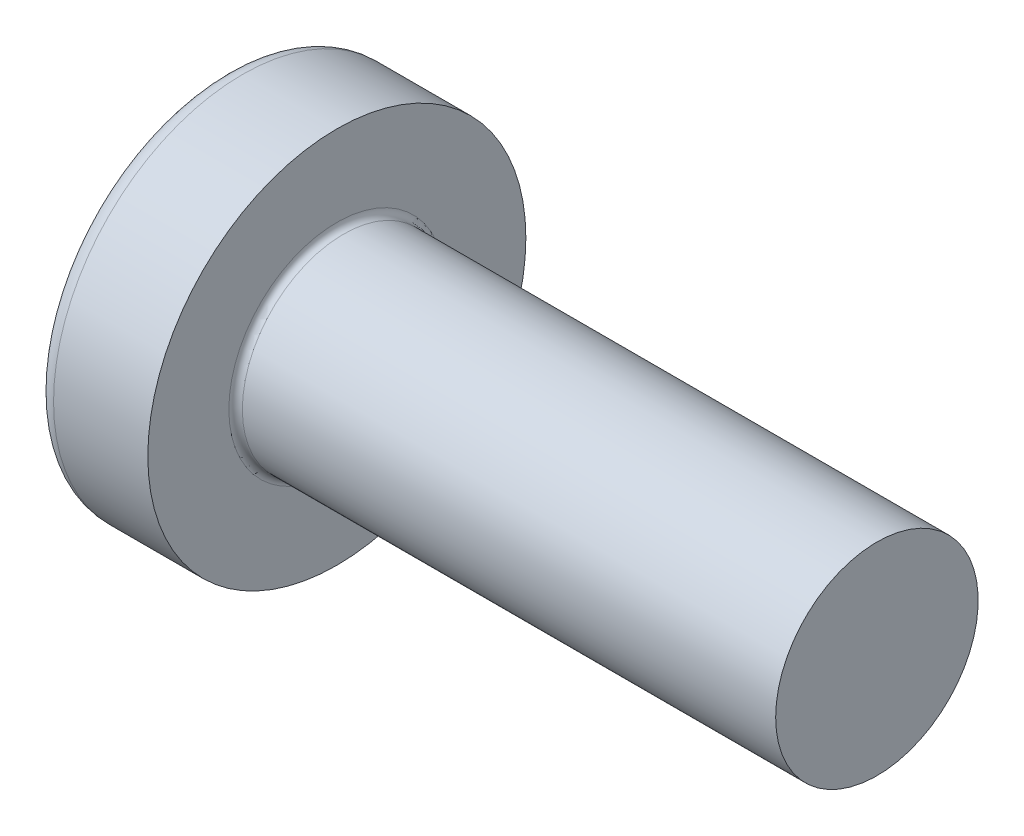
from build123d import *

# Parameters (mm, degrees)
FILLET1_R    = 0.1
RECPAT_COUNT = 2
RECPAT_ANGLE = 90


with BuildPart() as part:
    # BodySke → Base-Revolve (revolve)
    with BuildSketch(Plane.XY, mode=Mode.PRIVATE) as base_revolve_sk:
        with BuildLine():
            Line((2.4, 1.5), (2.4, 2.8))
            Line((2.4, 2.8), (1.003501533, 2.8))
            ThreePointArc((1.003501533, 2.8), (0.873295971, 2.76653015), (0.775371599, 2.674418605))
            ThreePointArc((0.775371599, 2.674418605), (0.197753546, 1.392274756), (0, 0))
            Line((0, 0), (10.4, 0))
            Line((10.4, 0), (10.4, 1.5))
            Line((10.4, 1.5), (2.4, 1.5))
        make_face()
    revolve(base_revolve_sk.sketch.rotate(Axis((1.003501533, 0, 0), (1, 0, 0)), 90), axis=Axis((1.003501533, 0, 0), (1, 0, 0)))

    # Fillet1
    fillet1_edges = [part.edges().sort_by_distance(p)[0] for p in [
        (2.4, 0, -1.5),
    ]]
    fillet(fillet1_edges, radius=FILLET1_R)

    # Sketch3 → Recess section 0
    with BuildSketch(Plane(origin=(0, 0, 0), x_dir=(0, 0, -1), z_dir=(1, 0, 0))):
        with BuildLine():
            Line((0.37, -1.4), (-0.37, -1.4))
            Line((-0.37, -1.4), (-0.37, 1.4))
            Line((-0.37, 1.4), (0.37, 1.4))
            Line((0.37, 1.4), (0.37, -1.4))
        make_face()
    # Sketch4 → Recess section 1
    with BuildSketch(Plane(origin=(1.75, 0, 0), x_dir=(0, 0, -1), z_dir=(1, 0, 0))):
        with BuildLine():
            Line((0.37, -0.527482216), (-0.37, -0.527482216))
            Line((-0.37, -0.527482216), (-0.37, 0.527482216))
            Line((-0.37, 0.527482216), (0.37, 0.527482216))
            Line((0.37, 0.527482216), (0.37, -0.527482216))
        make_face()
    recess = loft(mode=Mode.SUBTRACT)

    # RecPat: Recess ×2 about axis
    recpat_axis = Axis((0, 0, 0), (1, 0, 0))
    for i in range(1, RECPAT_COUNT):
        add(recess.rotate(recpat_axis, i * RECPAT_ANGLE / (RECPAT_COUNT - 1)), mode=Mode.SUBTRACT)

    # RecCorSke → RecessCore (revolve, cut)
    with BuildSketch(Plane.XY, mode=Mode.PRIVATE) as recesscore_sk:
        Polygon((0, 0), (0, 0.678371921), (1.75, 0.556), (1.930655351, 0), align=None)
    revolve(recesscore_sk.sketch.rotate(Axis((-3.175, 0, 0), (1, 0, 0)), 344.185974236), axis=Axis((-3.175, 0, 0), (1, 0, 0)), mode=Mode.SUBTRACT)


solid = part.part
